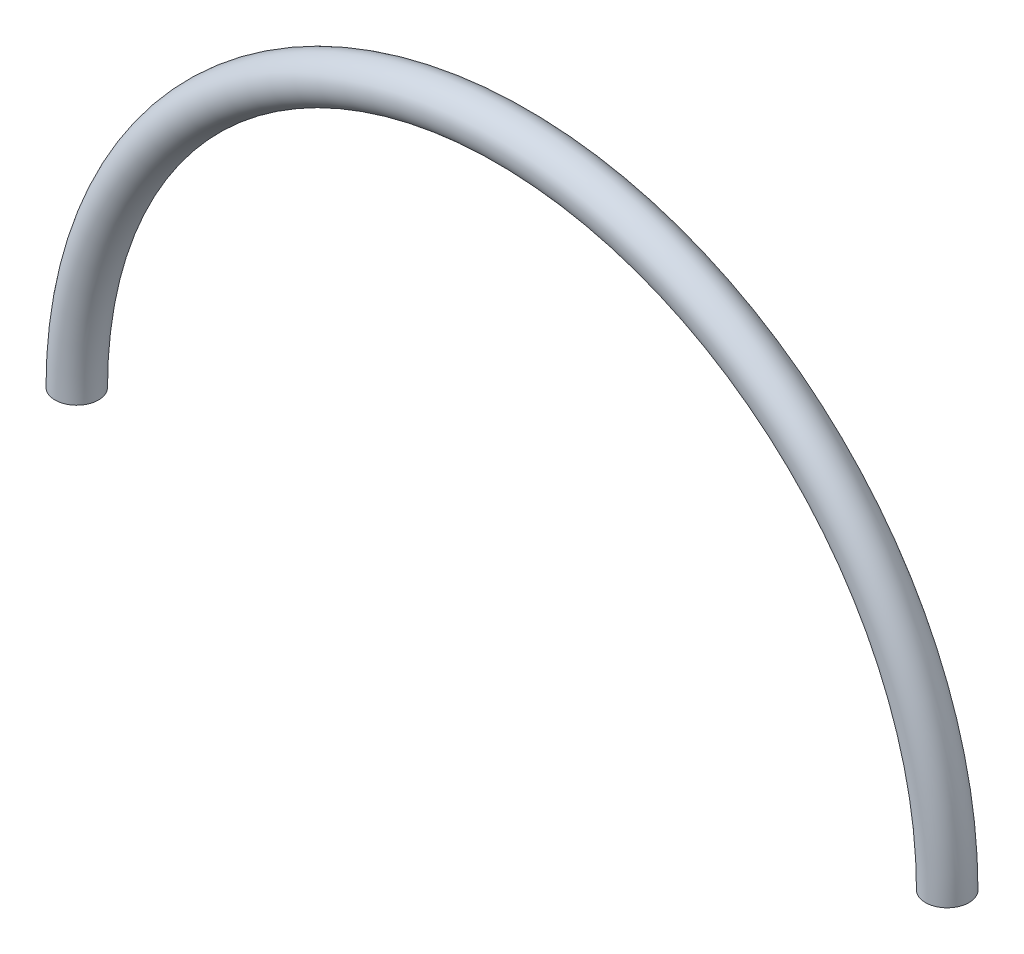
from build123d import *

# Parameters (mm, degrees)
SKETCH2_R = 0.5


with BuildPart() as part:
    # Basis-Austragung: sweep along a path in Sketch1
    with BuildLine(Plane.XY) as basis_austragung_path:
        ThreePointArc((10, 0), (0, 10), (-10, 0))
    # Sketch2 → Basis-Austragung (sweep)
    with BuildSketch(Plane(origin=(0, 0, 0), x_dir=(1, 0, 0), z_dir=(0, 1, 0))):
        with Locations((10, 0)):
            Circle(SKETCH2_R)
    sweep(path=basis_austragung_path.line)


solid = part.part
